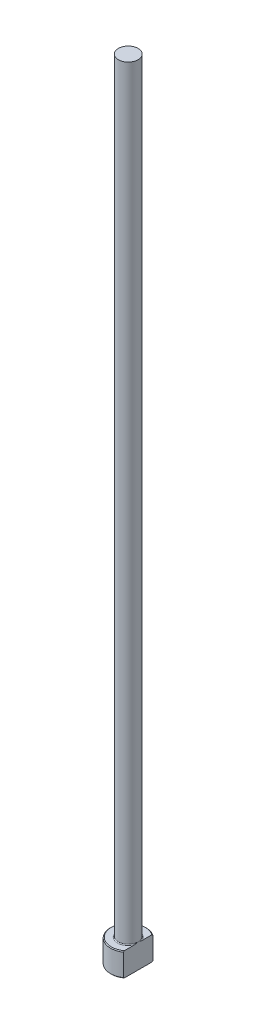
from build123d import *
from build123d.topology import SkipClean

# Parameters (mm, degrees)
CHAMFER1_SIZE    = 0.2
FILLET1_R        = 0.2
KEYED_HEAD_DEPTH = 201.101224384


with BuildPart() as part:
    # Sketch1 → Revolve1 (revolve)
    with BuildSketch(Plane.XY, mode=Mode.PRIVATE) as revolve1_sk:
        Polygon((0, 0), (-4.5, 0), (-4.5, 6), (-2.5, 6), (-2.5, 200), (0, 200), align=None)
    revolve(revolve1_sk.sketch.rotate(Axis((0, 259.958771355, 0), (0, -1, 0)), 270), axis=Axis((0, 259.958771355, 0), (0, -1, 0)))

    # Chamfer1
    chamfer1_edges = [part.edges().sort_by_distance(p)[0] for p in [
        (0, 6, -4.5),
        (0, 0, -4.5),
    ]]
    chamfer(chamfer1_edges, length=CHAMFER1_SIZE)

    # Fillet1
    fillet1_edges = [part.edges().sort_by_distance(p)[0] for p in [
        (0, 6, -2.5),
    ]]
    fillet(fillet1_edges, radius=FILLET1_R)

    # Sketch2 → KEYED HEAD (cut, through all)
    with SkipClean():  # the faces are left unmerged after this step: merging them gives an invalid solid
        with BuildSketch(Plane(origin=(0, 0, 0), x_dir=(1, 0, 0), z_dir=(0, 1, 0))):
            with BuildLine():
                Line((2.5, -3.741657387), (2.5, 3.741657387))
                ThreePointArc((2.5, 3.741657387), (4.5, 0), (2.5, -3.741657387))
            make_face()
        extrude(amount=KEYED_HEAD_DEPTH, mode=Mode.SUBTRACT)


solid = part.part
